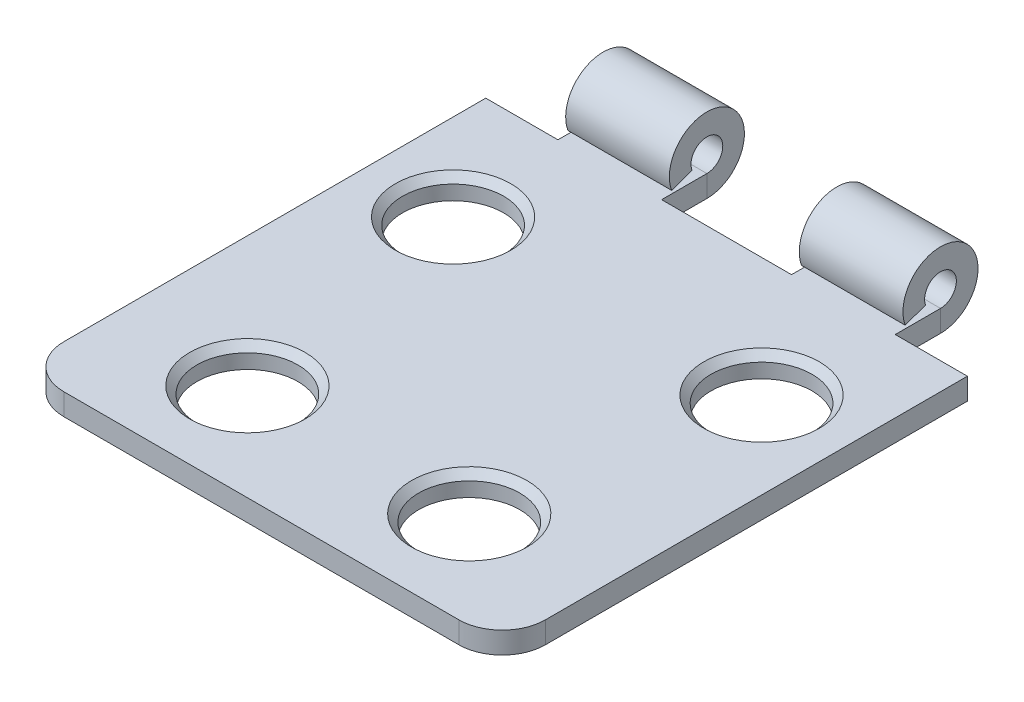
ISO-10303-21;
HEADER;
FILE_DESCRIPTION(('STEP AP214'),'2;1');
FILE_NAME('part.step','',(''),(''),'','','');
FILE_SCHEMA(('AUTOMOTIVE_DESIGN { 1 0 10303 214 1 1 1 1 }'));
ENDSEC;
DATA;
#1=APPLICATION_CONTEXT('core data for automotive mechanical design processes');
#2=APPLICATION_PROTOCOL_DEFINITION('international standard','automotive_design',2000,#1);
#3=PRODUCT_CONTEXT('',#1,'mechanical');
#4=PRODUCT('Part','Part','',(#3));
#5=PRODUCT_RELATED_PRODUCT_CATEGORY('part','',(#4));
#6=PRODUCT_DEFINITION_FORMATION('','',#4);
#7=PRODUCT_DEFINITION_CONTEXT('part definition',#1,'design');
#8=PRODUCT_DEFINITION('design','',#6,#7);
#9=PRODUCT_DEFINITION_SHAPE('','',#8);
#10=(LENGTH_UNIT() NAMED_UNIT(*) SI_UNIT(.MILLI.,.METRE.));
#11=(NAMED_UNIT(*) PLANE_ANGLE_UNIT() SI_UNIT($,.RADIAN.));
#12=(NAMED_UNIT(*) SI_UNIT($,.STERADIAN.) SOLID_ANGLE_UNIT());
#13=UNCERTAINTY_MEASURE_WITH_UNIT(LENGTH_MEASURE(1.E-05),#10,'distance_accuracy_value','');
#14=(GEOMETRIC_REPRESENTATION_CONTEXT(3) GLOBAL_UNCERTAINTY_ASSIGNED_CONTEXT((#13)) GLOBAL_UNIT_ASSIGNED_CONTEXT((#10,
#11,#12)) REPRESENTATION_CONTEXT('',''));
#15=CARTESIAN_POINT('',(0.,0.,0.));
#16=DIRECTION('',(0.,0.,1.));
#17=DIRECTION('',(1.,0.,0.));
#18=AXIS2_PLACEMENT_3D('',#15,#16,#17);
#19=CARTESIAN_POINT('',(7.47949999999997,-0.494291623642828,-7.42179302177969));
#20=DIRECTION('',(0.,1.,0.));
#21=DIRECTION('',(0.,0.,1.));
#22=AXIS2_PLACEMENT_3D('',#19,#20,#21);
#23=CONICAL_SURFACE('',#22,2.44999999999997,0.785398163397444);
#24=CARTESIAN_POINT('',(7.47949999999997,-0.144291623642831,-7.42179302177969));
#25=DIRECTION('',(0.,-1.,0.));
#26=DIRECTION('',(0.,0.,-1.));
#27=AXIS2_PLACEMENT_3D('',#24,#25,#26);
#28=CIRCLE('',#27,2.79999999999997);
#29=CARTESIAN_POINT('',(7.47949999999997,-0.144291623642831,-10.2217930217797));
#30=VERTEX_POINT('',#29);
#31=EDGE_CURVE('E342',#30,#30,#28,.T.);
#32=ORIENTED_EDGE('',*,*,#31,.F.);
#33=EDGE_LOOP('',(#32));
#34=FACE_BOUND('',#33,.T.);
#35=CARTESIAN_POINT('',(7.47949999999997,-0.494291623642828,-7.42179302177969));
#36=DIRECTION('',(0.,-1.,0.));
#37=DIRECTION('',(0.,0.,-1.));
#38=AXIS2_PLACEMENT_3D('',#35,#36,#37);
#39=CIRCLE('',#38,2.44999999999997);
#40=CARTESIAN_POINT('',(7.47949999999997,-0.494291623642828,-9.87179302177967));
#41=VERTEX_POINT('',#40);
#42=EDGE_CURVE('E215',#41,#41,#39,.F.);
#43=ORIENTED_EDGE('',*,*,#42,.F.);
#44=EDGE_LOOP('',(#43));
#45=FACE_BOUND('',#44,.T.);
#46=ADVANCED_FACE('F49',(#34,#45),#23,.F.);
#47=CARTESIAN_POINT('',(5.37949999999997,-0.494291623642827,4.6533491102));
#48=DIRECTION('',(0.,1.,0.));
#49=DIRECTION('',(0.,0.,1.));
#50=AXIS2_PLACEMENT_3D('',#47,#48,#49);
#51=CONICAL_SURFACE('',#50,2.45,0.78539816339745);
#52=CARTESIAN_POINT('',(5.37949999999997,-0.144291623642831,4.6533491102));
#53=DIRECTION('',(0.,-1.,0.));
#54=DIRECTION('',(0.,0.,-1.));
#55=AXIS2_PLACEMENT_3D('',#52,#53,#54);
#56=CIRCLE('',#55,2.8);
#57=CARTESIAN_POINT('',(5.37949999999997,-0.144291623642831,1.8533491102));
#58=VERTEX_POINT('',#57);
#59=EDGE_CURVE('E345',#58,#58,#56,.T.);
#60=ORIENTED_EDGE('',*,*,#59,.F.);
#61=EDGE_LOOP('',(#60));
#62=FACE_BOUND('',#61,.T.);
#63=CARTESIAN_POINT('',(5.37949999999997,-0.494291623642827,4.6533491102));
#64=DIRECTION('',(0.,-1.,0.));
#65=DIRECTION('',(0.,0.,-1.));
#66=AXIS2_PLACEMENT_3D('',#63,#64,#65);
#67=CIRCLE('',#66,2.45);
#68=CARTESIAN_POINT('',(5.37949999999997,-0.494291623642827,2.2033491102));
#69=VERTEX_POINT('',#68);
#70=EDGE_CURVE('E218',#69,#69,#67,.F.);
#71=ORIENTED_EDGE('',*,*,#70,.F.);
#72=EDGE_LOOP('',(#71));
#73=FACE_BOUND('',#72,.T.);
#74=ADVANCED_FACE('F420',(#62,#73),#51,.F.);
#75=CARTESIAN_POINT('',(-5.37950000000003,-0.494291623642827,4.6533491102));
#76=DIRECTION('',(0.,1.,0.));
#77=DIRECTION('',(0.,0.,1.));
#78=AXIS2_PLACEMENT_3D('',#75,#76,#77);
#79=CONICAL_SURFACE('',#78,2.45,0.78539816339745);
#80=CARTESIAN_POINT('',(-5.37950000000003,-0.144291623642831,4.6533491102));
#81=DIRECTION('',(0.,-1.,0.));
#82=DIRECTION('',(0.,0.,-1.));
#83=AXIS2_PLACEMENT_3D('',#80,#81,#82);
#84=CIRCLE('',#83,2.8);
#85=CARTESIAN_POINT('',(-5.37950000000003,-0.144291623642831,1.8533491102));
#86=VERTEX_POINT('',#85);
#87=EDGE_CURVE('E348',#86,#86,#84,.T.);
#88=ORIENTED_EDGE('',*,*,#87,.F.);
#89=EDGE_LOOP('',(#88));
#90=FACE_BOUND('',#89,.T.);
#91=CARTESIAN_POINT('',(-5.37950000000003,-0.494291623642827,4.6533491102));
#92=DIRECTION('',(0.,-1.,0.));
#93=DIRECTION('',(0.,0.,-1.));
#94=AXIS2_PLACEMENT_3D('',#91,#92,#93);
#95=CIRCLE('',#94,2.45);
#96=CARTESIAN_POINT('',(-5.37950000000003,-0.494291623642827,2.2033491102));
#97=VERTEX_POINT('',#96);
#98=EDGE_CURVE('E221',#97,#97,#95,.F.);
#99=ORIENTED_EDGE('',*,*,#98,.F.);
#100=EDGE_LOOP('',(#99));
#101=FACE_BOUND('',#100,.T.);
#102=ADVANCED_FACE('F426',(#90,#101),#79,.F.);
#103=CARTESIAN_POINT('',(-7.47950000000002,-0.494291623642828,-7.42179302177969));
#104=DIRECTION('',(0.,1.,0.));
#105=DIRECTION('',(0.,0.,1.));
#106=AXIS2_PLACEMENT_3D('',#103,#104,#105);
#107=CONICAL_SURFACE('',#106,2.44999999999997,0.785398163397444);
#108=CARTESIAN_POINT('',(-7.47950000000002,-0.144291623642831,-7.42179302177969));
#109=DIRECTION('',(0.,-1.,0.));
#110=DIRECTION('',(0.,0.,-1.));
#111=AXIS2_PLACEMENT_3D('',#108,#109,#110);
#112=CIRCLE('',#111,2.79999999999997);
#113=CARTESIAN_POINT('',(-7.47950000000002,-0.144291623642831,-10.2217930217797));
#114=VERTEX_POINT('',#113);
#115=EDGE_CURVE('E351',#114,#114,#112,.T.);
#116=ORIENTED_EDGE('',*,*,#115,.F.);
#117=EDGE_LOOP('',(#116));
#118=FACE_BOUND('',#117,.T.);
#119=CARTESIAN_POINT('',(-7.47950000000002,-0.494291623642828,-7.42179302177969));
#120=DIRECTION('',(0.,-1.,0.));
#121=DIRECTION('',(0.,0.,-1.));
#122=AXIS2_PLACEMENT_3D('',#119,#120,#121);
#123=CIRCLE('',#122,2.44999999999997);
#124=CARTESIAN_POINT('',(-7.47950000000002,-0.494291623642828,-9.87179302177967));
#125=VERTEX_POINT('',#124);
#126=EDGE_CURVE('E224',#125,#125,#123,.F.);
#127=ORIENTED_EDGE('',*,*,#126,.F.);
#128=EDGE_LOOP('',(#127));
#129=FACE_BOUND('',#128,.T.);
#130=ADVANCED_FACE('F437',(#118,#129),#107,.F.);
#131=CARTESIAN_POINT('',(-7.47950000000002,-1.19429162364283,-7.42179302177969));
#132=DIRECTION('',(0.,1.,0.));
#133=DIRECTION('',(0.,0.,1.));
#134=AXIS2_PLACEMENT_3D('',#131,#132,#133);
#135=CYLINDRICAL_SURFACE('',#134,2.44999999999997);
#136=ORIENTED_EDGE('',*,*,#126,.T.);
#137=EDGE_LOOP('',(#136));
#138=FACE_BOUND('',#137,.T.);
#139=CARTESIAN_POINT('',(-7.47950000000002,-1.19429162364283,-7.42179302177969));
#140=DIRECTION('',(0.,1.,0.));
#141=DIRECTION('',(0.,0.,1.));
#142=AXIS2_PLACEMENT_3D('',#139,#140,#141);
#143=CIRCLE('',#142,2.44999999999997);
#144=CARTESIAN_POINT('',(-7.47950000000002,-1.19429162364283,-4.97179302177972));
#145=VERTEX_POINT('',#144);
#146=EDGE_CURVE('E360',#145,#145,#143,.T.);
#147=ORIENTED_EDGE('',*,*,#146,.F.);
#148=EDGE_LOOP('',(#147));
#149=FACE_BOUND('',#148,.T.);
#150=ADVANCED_FACE('F441',(#138,#149),#135,.F.);
#151=CARTESIAN_POINT('',(-5.37950000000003,-1.19429162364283,4.6533491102));
#152=DIRECTION('',(0.,1.,0.));
#153=DIRECTION('',(0.,0.,1.));
#154=AXIS2_PLACEMENT_3D('',#151,#152,#153);
#155=CYLINDRICAL_SURFACE('',#154,2.45);
#156=ORIENTED_EDGE('',*,*,#98,.T.);
#157=EDGE_LOOP('',(#156));
#158=FACE_BOUND('',#157,.T.);
#159=CARTESIAN_POINT('',(-5.37950000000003,-1.19429162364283,4.6533491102));
#160=DIRECTION('',(0.,1.,0.));
#161=DIRECTION('',(0.,0.,1.));
#162=AXIS2_PLACEMENT_3D('',#159,#160,#161);
#163=CIRCLE('',#162,2.45);
#164=CARTESIAN_POINT('',(-5.37950000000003,-1.19429162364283,7.1033491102));
#165=VERTEX_POINT('',#164);
#166=EDGE_CURVE('E363',#165,#165,#163,.T.);
#167=ORIENTED_EDGE('',*,*,#166,.F.);
#168=EDGE_LOOP('',(#167));
#169=FACE_BOUND('',#168,.T.);
#170=ADVANCED_FACE('F445',(#158,#169),#155,.F.);
#171=CARTESIAN_POINT('',(5.37949999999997,-1.19429162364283,4.6533491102));
#172=DIRECTION('',(0.,1.,0.));
#173=DIRECTION('',(0.,0.,1.));
#174=AXIS2_PLACEMENT_3D('',#171,#172,#173);
#175=CYLINDRICAL_SURFACE('',#174,2.45);
#176=ORIENTED_EDGE('',*,*,#70,.T.);
#177=EDGE_LOOP('',(#176));
#178=FACE_BOUND('',#177,.T.);
#179=CARTESIAN_POINT('',(5.37949999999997,-1.19429162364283,4.6533491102));
#180=DIRECTION('',(0.,1.,0.));
#181=DIRECTION('',(0.,0.,-1.));
#182=AXIS2_PLACEMENT_3D('',#179,#180,#181);
#183=CIRCLE('',#182,2.45);
#184=CARTESIAN_POINT('',(5.37949999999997,-1.19429162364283,2.2033491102));
#185=VERTEX_POINT('',#184);
#186=EDGE_CURVE('E366',#185,#185,#183,.T.);
#187=ORIENTED_EDGE('',*,*,#186,.F.);
#188=EDGE_LOOP('',(#187));
#189=FACE_BOUND('',#188,.T.);
#190=ADVANCED_FACE('F449',(#178,#189),#175,.F.);
#191=CARTESIAN_POINT('',(7.47949999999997,-1.19429162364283,-7.42179302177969));
#192=DIRECTION('',(0.,1.,0.));
#193=DIRECTION('',(0.,0.,1.));
#194=AXIS2_PLACEMENT_3D('',#191,#192,#193);
#195=CYLINDRICAL_SURFACE('',#194,2.44999999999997);
#196=ORIENTED_EDGE('',*,*,#42,.T.);
#197=EDGE_LOOP('',(#196));
#198=FACE_BOUND('',#197,.T.);
#199=CARTESIAN_POINT('',(7.47949999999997,-1.19429162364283,-7.42179302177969));
#200=DIRECTION('',(0.,1.,0.));
#201=DIRECTION('',(0.,0.,-1.));
#202=AXIS2_PLACEMENT_3D('',#199,#200,#201);
#203=CIRCLE('',#202,2.44999999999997);
#204=CARTESIAN_POINT('',(7.47949999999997,-1.19429162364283,-9.87179302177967));
#205=VERTEX_POINT('',#204);
#206=EDGE_CURVE('E369',#205,#205,#203,.T.);
#207=ORIENTED_EDGE('',*,*,#206,.F.);
#208=EDGE_LOOP('',(#207));
#209=FACE_BOUND('',#208,.T.);
#210=ADVANCED_FACE('F453',(#198,#209),#195,.F.);
#211=CARTESIAN_POINT('',(-3.15000000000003,-3.64429162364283,-13.2063770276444));
#212=DIRECTION('',(0.,0.,1.));
#213=DIRECTION('',(1.,0.,0.));
#214=AXIS2_PLACEMENT_3D('',#211,#212,#213);
#215=PLANE('',#214);
#216=DIRECTION('',(-1.,0.,0.));
#217=VECTOR('',#216,1.);
#218=CARTESIAN_POINT('',(-10.2795000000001,-1.19429162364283,-13.2063770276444));
#219=LINE('',#218,#217);
#220=CARTESIAN_POINT('',(3.14999999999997,-1.19429162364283,-13.2063770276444));
#221=VERTEX_POINT('',#220);
#222=CARTESIAN_POINT('',(-3.15000000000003,-1.19429162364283,-13.2063770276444));
#223=VERTEX_POINT('',#222);
#224=EDGE_CURVE('E213',#221,#223,#219,.T.);
#225=ORIENTED_EDGE('',*,*,#224,.T.);
#226=DIRECTION('',(0.,1.,0.));
#227=VECTOR('',#226,1.);
#228=CARTESIAN_POINT('',(-3.15000000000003,-3.64429162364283,-13.2063770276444));
#229=LINE('',#228,#227);
#230=CARTESIAN_POINT('',(-3.15000000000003,-0.144291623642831,-13.2063770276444));
#231=VERTEX_POINT('',#230);
#232=EDGE_CURVE('E211',#223,#231,#229,.T.);
#233=ORIENTED_EDGE('',*,*,#232,.T.);
#234=DIRECTION('',(1.,0.,0.));
#235=VECTOR('',#234,1.);
#236=CARTESIAN_POINT('',(-3.15000000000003,-0.144291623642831,-13.2063770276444));
#237=LINE('',#236,#235);
#238=CARTESIAN_POINT('',(3.14999999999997,-0.144291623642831,-13.2063770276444));
#239=VERTEX_POINT('',#238);
#240=EDGE_CURVE('E205',#231,#239,#237,.T.);
#241=ORIENTED_EDGE('',*,*,#240,.T.);
#242=DIRECTION('',(0.,1.,0.));
#243=VECTOR('',#242,1.);
#244=CARTESIAN_POINT('',(3.14999999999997,-3.64429162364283,-13.2063770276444));
#245=LINE('',#244,#243);
#246=EDGE_CURVE('E338',#221,#239,#245,.T.);
#247=ORIENTED_EDGE('',*,*,#246,.F.);
#248=EDGE_LOOP('',(#225,#233,#241,#247));
#249=FACE_BOUND('',#248,.T.);
#250=ADVANCED_FACE('F457',(#249),#215,.F.);
#251=CARTESIAN_POINT('',(-8.17950000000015,-3.64429162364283,-13.2063770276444));
#252=DIRECTION('',(0.,0.,1.));
#253=DIRECTION('',(1.,0.,0.));
#254=AXIS2_PLACEMENT_3D('',#251,#252,#253);
#255=PLANE('',#254);
#256=DIRECTION('',(-1.,0.,0.));
#257=VECTOR('',#256,1.);
#258=CARTESIAN_POINT('',(-10.2795,-1.19429162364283,-13.2063770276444));
#259=LINE('',#258,#257);
#260=CARTESIAN_POINT('',(-8.17950000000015,-1.19429162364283,-13.2063770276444));
#261=VERTEX_POINT('',#260);
#262=CARTESIAN_POINT('',(-11.6795000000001,-1.19429162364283,-13.2063770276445));
#263=VERTEX_POINT('',#262);
#264=EDGE_CURVE('E193',#261,#263,#259,.T.);
#265=ORIENTED_EDGE('',*,*,#264,.T.);
#266=DIRECTION('',(0.,1.,0.));
#267=VECTOR('',#266,1.);
#268=CARTESIAN_POINT('',(-11.6795000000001,-7.14429162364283,-13.2063770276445));
#269=LINE('',#268,#267);
#270=CARTESIAN_POINT('',(-11.6795000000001,-0.144291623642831,-13.2063770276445));
#271=VERTEX_POINT('',#270);
#272=EDGE_CURVE('E179',#263,#271,#269,.T.);
#273=ORIENTED_EDGE('',*,*,#272,.T.);
#274=DIRECTION('',(1.,0.,0.));
#275=VECTOR('',#274,1.);
#276=CARTESIAN_POINT('',(-8.17950000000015,-0.144291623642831,-13.2063770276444));
#277=LINE('',#276,#275);
#278=CARTESIAN_POINT('',(-8.17950000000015,-0.144291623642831,-13.2063770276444));
#279=VERTEX_POINT('',#278);
#280=EDGE_CURVE('E190',#271,#279,#277,.T.);
#281=ORIENTED_EDGE('',*,*,#280,.T.);
#282=DIRECTION('',(0.,1.,0.));
#283=VECTOR('',#282,1.);
#284=CARTESIAN_POINT('',(-8.17950000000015,-3.64429162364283,-13.2063770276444));
#285=LINE('',#284,#283);
#286=EDGE_CURVE('E326',#261,#279,#285,.T.);
#287=ORIENTED_EDGE('',*,*,#286,.F.);
#288=EDGE_LOOP('',(#265,#273,#281,#287));
#289=FACE_BOUND('',#288,.T.);
#290=ADVANCED_FACE('F188',(#289),#255,.F.);
#291=CARTESIAN_POINT('',(14.4794999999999,-3.64429162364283,-13.2063770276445));
#292=DIRECTION('',(0.,0.,1.));
#293=DIRECTION('',(1.,0.,0.));
#294=AXIS2_PLACEMENT_3D('',#291,#292,#293);
#295=PLANE('',#294);
#296=DIRECTION('',(1.,0.,0.));
#297=VECTOR('',#296,1.);
#298=CARTESIAN_POINT('',(14.4794999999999,-0.144291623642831,-13.2063770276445));
#299=LINE('',#298,#297);
#300=CARTESIAN_POINT('',(8.17949999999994,-0.144291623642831,-13.2063770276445));
#301=VERTEX_POINT('',#300);
#302=CARTESIAN_POINT('',(11.6795000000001,-0.144291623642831,-13.2063770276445));
#303=VERTEX_POINT('',#302);
#304=EDGE_CURVE('E376',#301,#303,#299,.T.);
#305=ORIENTED_EDGE('',*,*,#304,.T.);
#306=DIRECTION('',(0.,1.,0.));
#307=VECTOR('',#306,1.);
#308=CARTESIAN_POINT('',(11.6795000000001,-7.14429162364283,-13.2063770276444));
#309=LINE('',#308,#307);
#310=CARTESIAN_POINT('',(11.6795000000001,-1.19429162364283,-13.2063770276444));
#311=VERTEX_POINT('',#310);
#312=EDGE_CURVE('E267',#311,#303,#309,.T.);
#313=ORIENTED_EDGE('',*,*,#312,.F.);
#314=DIRECTION('',(-1.,0.,0.));
#315=VECTOR('',#314,1.);
#316=CARTESIAN_POINT('',(-10.2795000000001,-1.19429162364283,-13.2063770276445));
#317=LINE('',#316,#315);
#318=CARTESIAN_POINT('',(8.17949999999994,-1.19429162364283,-13.2063770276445));
#319=VERTEX_POINT('',#318);
#320=EDGE_CURVE('E201',#311,#319,#317,.T.);
#321=ORIENTED_EDGE('',*,*,#320,.T.);
#322=DIRECTION('',(0.,1.,0.));
#323=VECTOR('',#322,1.);
#324=CARTESIAN_POINT('',(8.17949999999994,-3.64429162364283,-13.2063770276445));
#325=LINE('',#324,#323);
#326=EDGE_CURVE('E203',#319,#301,#325,.T.);
#327=ORIENTED_EDGE('',*,*,#326,.T.);
#328=EDGE_LOOP('',(#305,#313,#321,#327));
#329=FACE_BOUND('',#328,.T.);
#330=ADVANCED_FACE('F379',(#329),#295,.F.);
#331=CARTESIAN_POINT('',(-10.2795000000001,-1.19429162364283,10.4772069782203));
#332=DIRECTION('',(0.,-1.,0.));
#333=DIRECTION('',(0.,0.,-1.));
#334=AXIS2_PLACEMENT_3D('',#331,#332,#333);
#335=PLANE('',#334);
#336=DIRECTION('',(0.,0.,-1.));
#337=VECTOR('',#336,1.);
#338=CARTESIAN_POINT('',(11.6795,-1.19429162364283,10.4772069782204));
#339=LINE('',#338,#337);
#340=CARTESIAN_POINT('',(11.6795,-1.19429162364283,7.25720697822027));
#341=VERTEX_POINT('',#340);
#342=EDGE_CURVE('E194',#341,#311,#339,.T.);
#343=ORIENTED_EDGE('',*,*,#342,.F.);
#344=CARTESIAN_POINT('',(9.57949999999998,-1.19429162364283,7.25720697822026));
#345=DIRECTION('',(0.,-1.,0.));
#346=DIRECTION('',(0.,0.,-1.));
#347=AXIS2_PLACEMENT_3D('',#344,#345,#346);
#348=CIRCLE('',#347,2.1);
#349=CARTESIAN_POINT('',(9.57949999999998,-1.19429162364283,9.35720697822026));
#350=VERTEX_POINT('',#349);
#351=EDGE_CURVE('E57',#341,#350,#348,.T.);
#352=ORIENTED_EDGE('',*,*,#351,.T.);
#353=DIRECTION('',(1.,0.,0.));
#354=VECTOR('',#353,1.);
#355=CARTESIAN_POINT('',(-10.2795000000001,-1.19429162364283,9.35720697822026));
#356=LINE('',#355,#354);
#357=CARTESIAN_POINT('',(-9.57950000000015,-1.19429162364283,9.35720697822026));
#358=VERTEX_POINT('',#357);
#359=EDGE_CURVE('E259',#358,#350,#356,.T.);
#360=ORIENTED_EDGE('',*,*,#359,.F.);
#361=CARTESIAN_POINT('',(-9.57950000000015,-1.19429162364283,7.25720697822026));
#362=DIRECTION('',(0.,-1.,0.));
#363=DIRECTION('',(0.,0.,-1.));
#364=AXIS2_PLACEMENT_3D('',#361,#362,#363);
#365=CIRCLE('',#364,2.1);
#366=CARTESIAN_POINT('',(-11.6795000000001,-1.19429162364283,7.25720697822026));
#367=VERTEX_POINT('',#366);
#368=EDGE_CURVE('E64',#358,#367,#365,.T.);
#369=ORIENTED_EDGE('',*,*,#368,.T.);
#370=DIRECTION('',(0.,0.,1.));
#371=VECTOR('',#370,1.);
#372=CARTESIAN_POINT('',(-11.6795000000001,-1.19429162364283,10.4772069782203));
#373=LINE('',#372,#371);
#374=EDGE_CURVE('E280',#263,#367,#373,.T.);
#375=ORIENTED_EDGE('',*,*,#374,.F.);
#376=ORIENTED_EDGE('',*,*,#264,.F.);
#377=DIRECTION('',(0.,0.,1.));
#378=VECTOR('',#377,1.);
#379=CARTESIAN_POINT('',(-8.17950000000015,-1.19429162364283,10.4772069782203));
#380=LINE('',#379,#378);
#381=CARTESIAN_POINT('',(-8.17950000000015,-1.19429162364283,-15.4017930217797));
#382=VERTEX_POINT('',#381);
#383=EDGE_CURVE('E328',#382,#261,#380,.T.);
#384=ORIENTED_EDGE('',*,*,#383,.F.);
#385=DIRECTION('',(1.,0.,0.));
#386=VECTOR('',#385,1.);
#387=CARTESIAN_POINT('',(-14.4795000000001,-1.19429162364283,-15.4017930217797));
#388=LINE('',#387,#386);
#389=CARTESIAN_POINT('',(-3.15000000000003,-1.19429162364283,-15.4017930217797));
#390=VERTEX_POINT('',#389);
#391=EDGE_CURVE('E374',#382,#390,#388,.T.);
#392=ORIENTED_EDGE('',*,*,#391,.T.);
#393=DIRECTION('',(0.,0.,-1.));
#394=VECTOR('',#393,1.);
#395=CARTESIAN_POINT('',(-3.15000000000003,-1.19429162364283,10.4772069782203));
#396=LINE('',#395,#394);
#397=EDGE_CURVE('E330',#223,#390,#396,.T.);
#398=ORIENTED_EDGE('',*,*,#397,.F.);
#399=ORIENTED_EDGE('',*,*,#224,.F.);
#400=DIRECTION('',(0.,0.,1.));
#401=VECTOR('',#400,1.);
#402=CARTESIAN_POINT('',(3.14999999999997,-1.19429162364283,10.4772069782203));
#403=LINE('',#402,#401);
#404=CARTESIAN_POINT('',(3.14999999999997,-1.19429162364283,-15.4017930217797));
#405=VERTEX_POINT('',#404);
#406=EDGE_CURVE('E340',#405,#221,#403,.T.);
#407=ORIENTED_EDGE('',*,*,#406,.F.);
#408=DIRECTION('',(1.,0.,0.));
#409=VECTOR('',#408,1.);
#410=CARTESIAN_POINT('',(-14.4795000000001,-1.19429162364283,-15.4017930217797));
#411=LINE('',#410,#409);
#412=CARTESIAN_POINT('',(8.17949999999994,-1.19429162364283,-15.4017930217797));
#413=VERTEX_POINT('',#412);
#414=EDGE_CURVE('E372',#405,#413,#411,.T.);
#415=ORIENTED_EDGE('',*,*,#414,.T.);
#416=DIRECTION('',(0.,0.,-1.));
#417=VECTOR('',#416,1.);
#418=CARTESIAN_POINT('',(8.17949999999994,-1.19429162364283,10.4772069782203));
#419=LINE('',#418,#417);
#420=EDGE_CURVE('E354',#319,#413,#419,.T.);
#421=ORIENTED_EDGE('',*,*,#420,.F.);
#422=ORIENTED_EDGE('',*,*,#320,.F.);
#423=EDGE_LOOP('',(#343,#352,#360,#369,#375,#376,#384,#392,#398,#399,#407,#415,#421,#422));
#424=FACE_BOUND('',#423,.T.);
#425=ORIENTED_EDGE('',*,*,#206,.T.);
#426=EDGE_LOOP('',(#425));
#427=FACE_BOUND('',#426,.T.);
#428=ORIENTED_EDGE('',*,*,#186,.T.);
#429=EDGE_LOOP('',(#428));
#430=FACE_BOUND('',#429,.T.);
#431=ORIENTED_EDGE('',*,*,#166,.T.);
#432=EDGE_LOOP('',(#431));
#433=FACE_BOUND('',#432,.T.);
#434=ORIENTED_EDGE('',*,*,#146,.T.);
#435=EDGE_LOOP('',(#434));
#436=FACE_BOUND('',#435,.T.);
#437=ADVANCED_FACE('F257',(#424,#427,#430,#433,#436),#335,.T.);
#438=CARTESIAN_POINT('',(8.17949999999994,-3.64429162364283,-21.9563770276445));
#439=DIRECTION('',(-1.,0.,0.));
#440=DIRECTION('',(0.,0.,1.));
#441=AXIS2_PLACEMENT_3D('',#438,#439,#440);
#442=PLANE('',#441);
#443=DIRECTION('',(0.,-1.,0.));
#444=VECTOR('',#443,1.);
#445=CARTESIAN_POINT('',(8.17949999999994,-0.144291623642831,-15.4017930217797));
#446=LINE('',#445,#444);
#447=CARTESIAN_POINT('',(8.17949999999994,-0.144291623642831,-15.4017930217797));
#448=VERTEX_POINT('',#447);
#449=EDGE_CURVE('E227',#448,#413,#446,.T.);
#450=ORIENTED_EDGE('',*,*,#449,.F.);
#451=DIRECTION('',(0.,0.,1.));
#452=VECTOR('',#451,1.);
#453=CARTESIAN_POINT('',(8.17949999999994,-0.144291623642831,-21.9563770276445));
#454=LINE('',#453,#452);
#455=EDGE_CURVE('E357',#448,#301,#454,.T.);
#456=ORIENTED_EDGE('',*,*,#455,.T.);
#457=ORIENTED_EDGE('',*,*,#326,.F.);
#458=ORIENTED_EDGE('',*,*,#420,.T.);
#459=EDGE_LOOP('',(#450,#456,#457,#458));
#460=FACE_BOUND('',#459,.T.);
#461=ADVANCED_FACE('F383',(#460),#442,.F.);
#462=CARTESIAN_POINT('',(-10.2795000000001,-0.144291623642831,10.4772069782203));
#463=DIRECTION('',(0.,-1.,0.));
#464=DIRECTION('',(0.,0.,-1.));
#465=AXIS2_PLACEMENT_3D('',#462,#463,#464);
#466=PLANE('',#465);
#467=ORIENTED_EDGE('',*,*,#115,.T.);
#468=EDGE_LOOP('',(#467));
#469=FACE_BOUND('',#468,.T.);
#470=ORIENTED_EDGE('',*,*,#87,.T.);
#471=EDGE_LOOP('',(#470));
#472=FACE_BOUND('',#471,.T.);
#473=ORIENTED_EDGE('',*,*,#59,.T.);
#474=EDGE_LOOP('',(#473));
#475=FACE_BOUND('',#474,.T.);
#476=ORIENTED_EDGE('',*,*,#31,.T.);
#477=EDGE_LOOP('',(#476));
#478=FACE_BOUND('',#477,.T.);
#479=DIRECTION('',(-1.,0.,0.));
#480=VECTOR('',#479,1.);
#481=CARTESIAN_POINT('',(-12.0918756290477,-0.144291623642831,9.35720697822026));
#482=LINE('',#481,#480);
#483=CARTESIAN_POINT('',(9.57949999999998,-0.144291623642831,9.35720697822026));
#484=VERTEX_POINT('',#483);
#485=CARTESIAN_POINT('',(-9.57950000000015,-0.144291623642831,9.35720697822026));
#486=VERTEX_POINT('',#485);
#487=EDGE_CURVE('E268',#484,#486,#482,.T.);
#488=ORIENTED_EDGE('',*,*,#487,.F.);
#489=CARTESIAN_POINT('',(9.57949999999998,-0.144291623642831,7.25720697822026));
#490=DIRECTION('',(0.,-1.,0.));
#491=DIRECTION('',(0.,0.,-1.));
#492=AXIS2_PLACEMENT_3D('',#489,#490,#491);
#493=CIRCLE('',#492,2.1);
#494=CARTESIAN_POINT('',(11.6795,-0.144291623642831,7.25720697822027));
#495=VERTEX_POINT('',#494);
#496=EDGE_CURVE('E252',#484,#495,#493,.F.);
#497=ORIENTED_EDGE('',*,*,#496,.T.);
#498=DIRECTION('',(0.,0.,1.));
#499=VECTOR('',#498,1.);
#500=CARTESIAN_POINT('',(11.6795000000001,-0.144291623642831,-13.2063770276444));
#501=LINE('',#500,#499);
#502=EDGE_CURVE('E195',#303,#495,#501,.T.);
#503=ORIENTED_EDGE('',*,*,#502,.F.);
#504=ORIENTED_EDGE('',*,*,#304,.F.);
#505=ORIENTED_EDGE('',*,*,#455,.F.);
#506=DIRECTION('',(1.,0.,0.));
#507=VECTOR('',#506,1.);
#508=CARTESIAN_POINT('',(-14.4795000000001,-0.144291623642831,-15.4017930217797));
#509=LINE('',#508,#507);
#510=CARTESIAN_POINT('',(3.14999999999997,-0.144291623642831,-15.4017930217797));
#511=VERTEX_POINT('',#510);
#512=EDGE_CURVE('E230',#511,#448,#509,.T.);
#513=ORIENTED_EDGE('',*,*,#512,.F.);
#514=DIRECTION('',(0.,0.,-1.));
#515=VECTOR('',#514,1.);
#516=CARTESIAN_POINT('',(3.14999999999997,-0.144291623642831,-13.2063770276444));
#517=LINE('',#516,#515);
#518=EDGE_CURVE('E336',#239,#511,#517,.T.);
#519=ORIENTED_EDGE('',*,*,#518,.F.);
#520=ORIENTED_EDGE('',*,*,#240,.F.);
#521=DIRECTION('',(0.,0.,1.));
#522=VECTOR('',#521,1.);
#523=CARTESIAN_POINT('',(-3.15000000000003,-0.144291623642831,-13.2063770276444));
#524=LINE('',#523,#522);
#525=CARTESIAN_POINT('',(-3.15000000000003,-0.144291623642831,-15.4017930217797));
#526=VERTEX_POINT('',#525);
#527=EDGE_CURVE('E333',#526,#231,#524,.T.);
#528=ORIENTED_EDGE('',*,*,#527,.F.);
#529=DIRECTION('',(1.,0.,0.));
#530=VECTOR('',#529,1.);
#531=CARTESIAN_POINT('',(-14.4795000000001,-0.144291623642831,-15.4017930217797));
#532=LINE('',#531,#530);
#533=CARTESIAN_POINT('',(-8.17950000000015,-0.144291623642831,-15.4017930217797));
#534=VERTEX_POINT('',#533);
#535=EDGE_CURVE('E239',#534,#526,#532,.T.);
#536=ORIENTED_EDGE('',*,*,#535,.F.);
#537=DIRECTION('',(0.,0.,-1.));
#538=VECTOR('',#537,1.);
#539=CARTESIAN_POINT('',(-8.17950000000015,-0.144291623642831,-21.9563770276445));
#540=LINE('',#539,#538);
#541=EDGE_CURVE('E184',#279,#534,#540,.T.);
#542=ORIENTED_EDGE('',*,*,#541,.F.);
#543=ORIENTED_EDGE('',*,*,#280,.F.);
#544=DIRECTION('',(0.,0.,1.));
#545=VECTOR('',#544,1.);
#546=CARTESIAN_POINT('',(-11.6795000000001,-0.144291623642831,10.4772069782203));
#547=LINE('',#546,#545);
#548=CARTESIAN_POINT('',(-11.6795000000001,-0.144291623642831,7.25720697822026));
#549=VERTEX_POINT('',#548);
#550=EDGE_CURVE('E176',#271,#549,#547,.T.);
#551=ORIENTED_EDGE('',*,*,#550,.T.);
#552=CARTESIAN_POINT('',(-9.57950000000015,-0.144291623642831,7.25720697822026));
#553=DIRECTION('',(0.,-1.,0.));
#554=DIRECTION('',(0.,0.,-1.));
#555=AXIS2_PLACEMENT_3D('',#552,#553,#554);
#556=CIRCLE('',#555,2.1);
#557=EDGE_CURVE('E250',#549,#486,#556,.F.);
#558=ORIENTED_EDGE('',*,*,#557,.T.);
#559=EDGE_LOOP('',(#488,#497,#503,#504,#505,#513,#519,#520,#528,#536,#542,#543,#551,#558));
#560=FACE_BOUND('',#559,.T.);
#561=ADVANCED_FACE('F199',(#469,#472,#475,#478,#560),#466,.F.);
#562=CARTESIAN_POINT('',(3.14999999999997,-3.64429162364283,-13.2063770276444));
#563=DIRECTION('',(1.,0.,0.));
#564=DIRECTION('',(0.,0.,-1.));
#565=AXIS2_PLACEMENT_3D('',#562,#563,#564);
#566=PLANE('',#565);
#567=DIRECTION('',(0.,1.,0.));
#568=VECTOR('',#567,1.);
#569=CARTESIAN_POINT('',(3.14999999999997,-1.19429162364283,-15.4017930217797));
#570=LINE('',#569,#568);
#571=EDGE_CURVE('E233',#405,#511,#570,.T.);
#572=ORIENTED_EDGE('',*,*,#571,.F.);
#573=ORIENTED_EDGE('',*,*,#406,.T.);
#574=ORIENTED_EDGE('',*,*,#246,.T.);
#575=ORIENTED_EDGE('',*,*,#518,.T.);
#576=EDGE_LOOP('',(#572,#573,#574,#575));
#577=FACE_BOUND('',#576,.T.);
#578=ADVANCED_FACE('F472',(#577),#566,.F.);
#579=CARTESIAN_POINT('',(-3.15000000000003,-3.64429162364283,-13.2063770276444));
#580=DIRECTION('',(-1.,0.,0.));
#581=DIRECTION('',(0.,0.,1.));
#582=AXIS2_PLACEMENT_3D('',#579,#580,#581);
#583=PLANE('',#582);
#584=DIRECTION('',(0.,-1.,0.));
#585=VECTOR('',#584,1.);
#586=CARTESIAN_POINT('',(-3.15000000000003,-0.144291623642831,-15.4017930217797));
#587=LINE('',#586,#585);
#588=EDGE_CURVE('E236',#526,#390,#587,.T.);
#589=ORIENTED_EDGE('',*,*,#588,.F.);
#590=ORIENTED_EDGE('',*,*,#527,.T.);
#591=ORIENTED_EDGE('',*,*,#232,.F.);
#592=ORIENTED_EDGE('',*,*,#397,.T.);
#593=EDGE_LOOP('',(#589,#590,#591,#592));
#594=FACE_BOUND('',#593,.T.);
#595=ADVANCED_FACE('F476',(#594),#583,.F.);
#596=CARTESIAN_POINT('',(-8.17950000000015,-3.64429162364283,-21.9563770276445));
#597=DIRECTION('',(1.,0.,0.));
#598=DIRECTION('',(0.,0.,-1.));
#599=AXIS2_PLACEMENT_3D('',#596,#597,#598);
#600=PLANE('',#599);
#601=DIRECTION('',(0.,1.,0.));
#602=VECTOR('',#601,1.);
#603=CARTESIAN_POINT('',(-8.17950000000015,-1.19429162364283,-15.4017930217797));
#604=LINE('',#603,#602);
#605=EDGE_CURVE('E242',#382,#534,#604,.T.);
#606=ORIENTED_EDGE('',*,*,#605,.F.);
#607=ORIENTED_EDGE('',*,*,#383,.T.);
#608=ORIENTED_EDGE('',*,*,#286,.T.);
#609=ORIENTED_EDGE('',*,*,#541,.T.);
#610=EDGE_LOOP('',(#606,#607,#608,#609));
#611=FACE_BOUND('',#610,.T.);
#612=ADVANCED_FACE('F479',(#611),#600,.F.);
#613=CARTESIAN_POINT('',(-8.17950000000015,0.625708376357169,-15.4017930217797));
#614=DIRECTION('',(-1.,0.,0.));
#615=DIRECTION('',(0.,0.,1.));
#616=AXIS2_PLACEMENT_3D('',#613,#614,#615);
#617=PLANE('',#616);
#618=ORIENTED_EDGE('',*,*,#605,.T.);
#619=CARTESIAN_POINT('',(-8.17950000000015,0.625708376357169,-15.4017930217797));
#620=DIRECTION('',(1.,0.,0.));
#621=DIRECTION('',(0.,0.,-1.));
#622=AXIS2_PLACEMENT_3D('',#619,#620,#621);
#623=CIRCLE('',#622,0.77);
#624=CARTESIAN_POINT('',(-8.17950000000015,0.362352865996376,-14.6782297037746));
#625=VERTEX_POINT('',#624);
#626=EDGE_CURVE('E303',#534,#625,#623,.T.);
#627=ORIENTED_EDGE('',*,*,#626,.T.);
#628=DIRECTION('',(0.,-0.342020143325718,0.93969262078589));
#629=VECTOR('',#628,1.);
#630=CARTESIAN_POINT('',(-8.17950000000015,0.00323171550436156,-13.6915524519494));
#631=LINE('',#630,#629);
#632=CARTESIAN_POINT('',(-8.17950000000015,0.00323171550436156,-13.6915524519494));
#633=VERTEX_POINT('',#632);
#634=EDGE_CURVE('E244',#625,#633,#631,.T.);
#635=ORIENTED_EDGE('',*,*,#634,.T.);
#636=CARTESIAN_POINT('',(-8.17950000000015,0.625708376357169,-15.4017930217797));
#637=DIRECTION('',(1.,0.,0.));
#638=DIRECTION('',(0.,0.,-1.));
#639=AXIS2_PLACEMENT_3D('',#636,#637,#638);
#640=CIRCLE('',#639,1.82);
#641=EDGE_CURVE('E305',#382,#633,#640,.T.);
#642=ORIENTED_EDGE('',*,*,#641,.F.);
#643=EDGE_LOOP('',(#618,#627,#635,#642));
#644=FACE_BOUND('',#643,.T.);
#645=ADVANCED_FACE('F432',(#644),#617,.T.);
#646=CARTESIAN_POINT('',(-5.66475000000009,0.00323171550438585,-13.6915524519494));
#647=DIRECTION('',(0.,-0.939692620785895,-0.342020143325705));
#648=DIRECTION('',(1.,0.,0.));
#649=AXIS2_PLACEMENT_3D('',#646,#647,#648);
#650=PLANE('',#649);
#651=ORIENTED_EDGE('',*,*,#634,.F.);
#652=DIRECTION('',(1.,0.,0.));
#653=VECTOR('',#652,1.);
#654=CARTESIAN_POINT('',(-13.9930716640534,0.362352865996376,-14.6782297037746));
#655=LINE('',#654,#653);
#656=CARTESIAN_POINT('',(-3.15000000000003,0.362352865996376,-14.6782297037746));
#657=VERTEX_POINT('',#656);
#658=EDGE_CURVE('E318',#625,#657,#655,.T.);
#659=ORIENTED_EDGE('',*,*,#658,.T.);
#660=DIRECTION('',(0.,-0.342020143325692,0.9396926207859));
#661=VECTOR('',#660,1.);
#662=CARTESIAN_POINT('',(-3.15000000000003,0.00323171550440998,-13.6915524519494));
#663=LINE('',#662,#661);
#664=CARTESIAN_POINT('',(-3.15000000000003,0.00323171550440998,-13.6915524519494));
#665=VERTEX_POINT('',#664);
#666=EDGE_CURVE('E315',#657,#665,#663,.T.);
#667=ORIENTED_EDGE('',*,*,#666,.T.);
#668=DIRECTION('',(1.,0.,0.));
#669=VECTOR('',#668,1.);
#670=CARTESIAN_POINT('',(-8.17950000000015,0.00323171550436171,-13.6915524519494));
#671=LINE('',#670,#669);
#672=EDGE_CURVE('E308',#633,#665,#671,.T.);
#673=ORIENTED_EDGE('',*,*,#672,.F.);
#674=EDGE_LOOP('',(#651,#659,#667,#673));
#675=FACE_BOUND('',#674,.T.);
#676=ADVANCED_FACE('F670',(#675),#650,.T.);
#677=CARTESIAN_POINT('',(-3.15000000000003,0.625708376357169,-15.4017930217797));
#678=DIRECTION('',(1.,0.,0.));
#679=DIRECTION('',(0.,0.,-1.));
#680=AXIS2_PLACEMENT_3D('',#677,#678,#679);
#681=PLANE('',#680);
#682=ORIENTED_EDGE('',*,*,#666,.F.);
#683=CARTESIAN_POINT('',(-3.15000000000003,0.625708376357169,-15.4017930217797));
#684=DIRECTION('',(1.,0.,0.));
#685=DIRECTION('',(0.,0.,-1.));
#686=AXIS2_PLACEMENT_3D('',#683,#684,#685);
#687=CIRCLE('',#686,0.77);
#688=EDGE_CURVE('E309',#657,#526,#687,.F.);
#689=ORIENTED_EDGE('',*,*,#688,.T.);
#690=ORIENTED_EDGE('',*,*,#588,.T.);
#691=CARTESIAN_POINT('',(-3.15000000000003,0.625708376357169,-15.4017930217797));
#692=DIRECTION('',(-1.,0.,0.));
#693=DIRECTION('',(0.,0.,1.));
#694=AXIS2_PLACEMENT_3D('',#691,#692,#693);
#695=CIRCLE('',#694,1.82);
#696=EDGE_CURVE('E312',#665,#390,#695,.T.);
#697=ORIENTED_EDGE('',*,*,#696,.F.);
#698=EDGE_LOOP('',(#682,#689,#690,#697));
#699=FACE_BOUND('',#698,.T.);
#700=ADVANCED_FACE('F676',(#699),#681,.T.);
#701=CARTESIAN_POINT('',(-13.9930716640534,0.625708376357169,-15.4017930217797));
#702=DIRECTION('',(1.,0.,0.));
#703=DIRECTION('',(0.,0.,-1.));
#704=AXIS2_PLACEMENT_3D('',#701,#702,#703);
#705=CYLINDRICAL_SURFACE('',#704,1.82);
#706=ORIENTED_EDGE('',*,*,#696,.T.);
#707=ORIENTED_EDGE('',*,*,#391,.F.);
#708=ORIENTED_EDGE('',*,*,#641,.T.);
#709=ORIENTED_EDGE('',*,*,#672,.T.);
#710=EDGE_LOOP('',(#706,#707,#708,#709));
#711=FACE_BOUND('',#710,.T.);
#712=ADVANCED_FACE('F415',(#711),#705,.T.);
#713=CARTESIAN_POINT('',(-13.9930716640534,0.625708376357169,-15.4017930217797));
#714=DIRECTION('',(1.,0.,0.));
#715=DIRECTION('',(0.,0.,-1.));
#716=AXIS2_PLACEMENT_3D('',#713,#714,#715);
#717=CYLINDRICAL_SURFACE('',#716,0.77);
#718=ORIENTED_EDGE('',*,*,#688,.F.);
#719=ORIENTED_EDGE('',*,*,#658,.F.);
#720=ORIENTED_EDGE('',*,*,#626,.F.);
#721=ORIENTED_EDGE('',*,*,#535,.T.);
#722=EDGE_LOOP('',(#718,#719,#720,#721));
#723=FACE_BOUND('',#722,.T.);
#724=ADVANCED_FACE('F408',(#723),#717,.F.);
#725=CARTESIAN_POINT('',(8.17949999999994,0.625708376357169,-15.4017930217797));
#726=DIRECTION('',(1.,0.,0.));
#727=DIRECTION('',(0.,0.,-1.));
#728=AXIS2_PLACEMENT_3D('',#725,#726,#727);
#729=PLANE('',#728);
#730=DIRECTION('',(0.,-0.342020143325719,0.93969262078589));
#731=VECTOR('',#730,1.);
#732=CARTESIAN_POINT('',(8.17949999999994,0.00323171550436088,-13.6915524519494));
#733=LINE('',#732,#731);
#734=CARTESIAN_POINT('',(8.17949999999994,0.362352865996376,-14.6782297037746));
#735=VERTEX_POINT('',#734);
#736=CARTESIAN_POINT('',(8.17949999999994,0.00323171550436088,-13.6915524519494));
#737=VERTEX_POINT('',#736);
#738=EDGE_CURVE('E301',#735,#737,#733,.T.);
#739=ORIENTED_EDGE('',*,*,#738,.F.);
#740=CARTESIAN_POINT('',(8.17949999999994,0.625708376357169,-15.4017930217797));
#741=DIRECTION('',(1.,0.,0.));
#742=DIRECTION('',(0.,0.,-1.));
#743=AXIS2_PLACEMENT_3D('',#740,#741,#742);
#744=CIRCLE('',#743,0.77);
#745=EDGE_CURVE('E282',#735,#448,#744,.F.);
#746=ORIENTED_EDGE('',*,*,#745,.T.);
#747=ORIENTED_EDGE('',*,*,#449,.T.);
#748=CARTESIAN_POINT('',(8.17949999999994,0.625708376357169,-15.4017930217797));
#749=DIRECTION('',(-1.,0.,0.));
#750=DIRECTION('',(0.,0.,1.));
#751=AXIS2_PLACEMENT_3D('',#748,#749,#750);
#752=CIRCLE('',#751,1.82);
#753=EDGE_CURVE('E283',#737,#413,#752,.T.);
#754=ORIENTED_EDGE('',*,*,#753,.F.);
#755=EDGE_LOOP('',(#739,#746,#747,#754));
#756=FACE_BOUND('',#755,.T.);
#757=ADVANCED_FACE('F406',(#756),#729,.T.);
#758=CARTESIAN_POINT('',(3.14999999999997,0.625708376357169,-15.4017930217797));
#759=DIRECTION('',(-1.,0.,0.));
#760=DIRECTION('',(0.,0.,1.));
#761=AXIS2_PLACEMENT_3D('',#758,#759,#760);
#762=PLANE('',#761);
#763=ORIENTED_EDGE('',*,*,#571,.T.);
#764=CARTESIAN_POINT('',(3.14999999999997,0.625708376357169,-15.4017930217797));
#765=DIRECTION('',(1.,0.,0.));
#766=DIRECTION('',(0.,0.,-1.));
#767=AXIS2_PLACEMENT_3D('',#764,#765,#766);
#768=CIRCLE('',#767,0.77);
#769=CARTESIAN_POINT('',(3.14999999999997,0.362352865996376,-14.6782297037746));
#770=VERTEX_POINT('',#769);
#771=EDGE_CURVE('E294',#511,#770,#768,.T.);
#772=ORIENTED_EDGE('',*,*,#771,.T.);
#773=DIRECTION('',(0.,-0.342020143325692,0.9396926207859));
#774=VECTOR('',#773,1.);
#775=CARTESIAN_POINT('',(3.14999999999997,0.00323171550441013,-13.6915524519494));
#776=LINE('',#775,#774);
#777=CARTESIAN_POINT('',(3.14999999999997,0.00323171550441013,-13.6915524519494));
#778=VERTEX_POINT('',#777);
#779=EDGE_CURVE('E293',#770,#778,#776,.T.);
#780=ORIENTED_EDGE('',*,*,#779,.T.);
#781=CARTESIAN_POINT('',(3.14999999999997,0.625708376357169,-15.4017930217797));
#782=DIRECTION('',(1.,0.,0.));
#783=DIRECTION('',(0.,0.,-1.));
#784=AXIS2_PLACEMENT_3D('',#781,#782,#783);
#785=CIRCLE('',#784,1.82);
#786=EDGE_CURVE('E286',#405,#778,#785,.T.);
#787=ORIENTED_EDGE('',*,*,#786,.F.);
#788=EDGE_LOOP('',(#763,#772,#780,#787));
#789=FACE_BOUND('',#788,.T.);
#790=ADVANCED_FACE('F393',(#789),#762,.T.);
#791=CARTESIAN_POINT('',(5.66474999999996,0.00323171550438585,-13.6915524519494));
#792=DIRECTION('',(0.,-0.939692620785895,-0.342020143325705));
#793=DIRECTION('',(1.,0.,0.));
#794=AXIS2_PLACEMENT_3D('',#791,#792,#793);
#795=PLANE('',#794);
#796=DIRECTION('',(1.,0.,0.));
#797=VECTOR('',#796,1.);
#798=CARTESIAN_POINT('',(-2.66357166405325,0.362352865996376,-14.6782297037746));
#799=LINE('',#798,#797);
#800=EDGE_CURVE('E287',#770,#735,#799,.T.);
#801=ORIENTED_EDGE('',*,*,#800,.T.);
#802=ORIENTED_EDGE('',*,*,#738,.T.);
#803=DIRECTION('',(1.,0.,0.));
#804=VECTOR('',#803,1.);
#805=CARTESIAN_POINT('',(3.14999999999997,0.00323171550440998,-13.6915524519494));
#806=LINE('',#805,#804);
#807=EDGE_CURVE('E290',#778,#737,#806,.T.);
#808=ORIENTED_EDGE('',*,*,#807,.F.);
#809=ORIENTED_EDGE('',*,*,#779,.F.);
#810=EDGE_LOOP('',(#801,#802,#808,#809));
#811=FACE_BOUND('',#810,.T.);
#812=ADVANCED_FACE('F399',(#811),#795,.T.);
#813=CARTESIAN_POINT('',(-2.66357166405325,0.625708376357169,-15.4017930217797));
#814=DIRECTION('',(1.,0.,0.));
#815=DIRECTION('',(0.,0.,-1.));
#816=AXIS2_PLACEMENT_3D('',#813,#814,#815);
#817=CYLINDRICAL_SURFACE('',#816,1.82);
#818=ORIENTED_EDGE('',*,*,#786,.T.);
#819=ORIENTED_EDGE('',*,*,#807,.T.);
#820=ORIENTED_EDGE('',*,*,#753,.T.);
#821=ORIENTED_EDGE('',*,*,#414,.F.);
#822=EDGE_LOOP('',(#818,#819,#820,#821));
#823=FACE_BOUND('',#822,.T.);
#824=ADVANCED_FACE('F403',(#823),#817,.T.);
#825=CARTESIAN_POINT('',(-2.66357166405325,0.625708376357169,-15.4017930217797));
#826=DIRECTION('',(1.,0.,0.));
#827=DIRECTION('',(0.,0.,-1.));
#828=AXIS2_PLACEMENT_3D('',#825,#826,#827);
#829=CYLINDRICAL_SURFACE('',#828,0.77);
#830=ORIENTED_EDGE('',*,*,#771,.F.);
#831=ORIENTED_EDGE('',*,*,#512,.T.);
#832=ORIENTED_EDGE('',*,*,#745,.F.);
#833=ORIENTED_EDGE('',*,*,#800,.F.);
#834=EDGE_LOOP('',(#830,#831,#832,#833));
#835=FACE_BOUND('',#834,.T.);
#836=ADVANCED_FACE('F397',(#835),#829,.F.);
#837=CARTESIAN_POINT('',(11.6795000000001,-7.14429162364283,-13.2063770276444));
#838=DIRECTION('',(-1.,0.,0.));
#839=DIRECTION('',(0.,0.,1.));
#840=AXIS2_PLACEMENT_3D('',#837,#838,#839);
#841=PLANE('',#840);
#842=ORIENTED_EDGE('',*,*,#502,.T.);
#843=DIRECTION('',(0.,1.,0.));
#844=VECTOR('',#843,1.);
#845=CARTESIAN_POINT('',(11.6795,-7.14429162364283,7.25720697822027));
#846=LINE('',#845,#844);
#847=EDGE_CURVE('E72',#495,#341,#846,.F.);
#848=ORIENTED_EDGE('',*,*,#847,.T.);
#849=ORIENTED_EDGE('',*,*,#342,.T.);
#850=ORIENTED_EDGE('',*,*,#312,.T.);
#851=EDGE_LOOP('',(#842,#848,#849,#850));
#852=FACE_BOUND('',#851,.T.);
#853=ADVANCED_FACE('F274',(#852),#841,.F.);
#854=CARTESIAN_POINT('',(-11.6795000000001,-7.14429162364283,-13.2063770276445));
#855=DIRECTION('',(1.,0.,0.));
#856=DIRECTION('',(0.,0.,-1.));
#857=AXIS2_PLACEMENT_3D('',#854,#855,#856);
#858=PLANE('',#857);
#859=ORIENTED_EDGE('',*,*,#374,.T.);
#860=DIRECTION('',(0.,1.,0.));
#861=VECTOR('',#860,1.);
#862=CARTESIAN_POINT('',(-11.6795000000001,-7.14429162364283,7.25720697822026));
#863=LINE('',#862,#861);
#864=EDGE_CURVE('E12',#367,#549,#863,.T.);
#865=ORIENTED_EDGE('',*,*,#864,.T.);
#866=ORIENTED_EDGE('',*,*,#550,.F.);
#867=ORIENTED_EDGE('',*,*,#272,.F.);
#868=EDGE_LOOP('',(#859,#865,#866,#867));
#869=FACE_BOUND('',#868,.T.);
#870=ADVANCED_FACE('F178',(#869),#858,.F.);
#871=CARTESIAN_POINT('',(-12.0918756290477,-7.14429162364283,9.35720697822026));
#872=DIRECTION('',(0.,0.,-1.));
#873=DIRECTION('',(-1.,0.,0.));
#874=AXIS2_PLACEMENT_3D('',#871,#872,#873);
#875=PLANE('',#874);
#876=ORIENTED_EDGE('',*,*,#359,.T.);
#877=DIRECTION('',(0.,1.,0.));
#878=VECTOR('',#877,1.);
#879=CARTESIAN_POINT('',(9.57949999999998,-7.14429162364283,9.35720697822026));
#880=LINE('',#879,#878);
#881=EDGE_CURVE('E247',#350,#484,#880,.T.);
#882=ORIENTED_EDGE('',*,*,#881,.T.);
#883=ORIENTED_EDGE('',*,*,#487,.T.);
#884=DIRECTION('',(0.,1.,0.));
#885=VECTOR('',#884,1.);
#886=CARTESIAN_POINT('',(-9.57950000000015,-7.14429162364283,9.35720697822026));
#887=LINE('',#886,#885);
#888=EDGE_CURVE('E183',#486,#358,#887,.F.);
#889=ORIENTED_EDGE('',*,*,#888,.T.);
#890=EDGE_LOOP('',(#876,#882,#883,#889));
#891=FACE_BOUND('',#890,.T.);
#892=ADVANCED_FACE('F264',(#891),#875,.F.);
#893=CARTESIAN_POINT('',(9.57949999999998,-7.14429162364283,7.25720697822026));
#894=DIRECTION('',(0.,1.,0.));
#895=DIRECTION('',(0.,0.,1.));
#896=AXIS2_PLACEMENT_3D('',#893,#894,#895);
#897=CYLINDRICAL_SURFACE('',#896,2.1);
#898=ORIENTED_EDGE('',*,*,#351,.F.);
#899=ORIENTED_EDGE('',*,*,#847,.F.);
#900=ORIENTED_EDGE('',*,*,#496,.F.);
#901=ORIENTED_EDGE('',*,*,#881,.F.);
#902=EDGE_LOOP('',(#898,#899,#900,#901));
#903=FACE_BOUND('',#902,.T.);
#904=ADVANCED_FACE('F270',(#903),#897,.T.);
#905=CARTESIAN_POINT('',(-9.57950000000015,-7.14429162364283,7.25720697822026));
#906=DIRECTION('',(0.,1.,0.));
#907=DIRECTION('',(0.,0.,1.));
#908=AXIS2_PLACEMENT_3D('',#905,#906,#907);
#909=CYLINDRICAL_SURFACE('',#908,2.1);
#910=ORIENTED_EDGE('',*,*,#368,.F.);
#911=ORIENTED_EDGE('',*,*,#888,.F.);
#912=ORIENTED_EDGE('',*,*,#557,.F.);
#913=ORIENTED_EDGE('',*,*,#864,.F.);
#914=EDGE_LOOP('',(#910,#911,#912,#913));
#915=FACE_BOUND('',#914,.T.);
#916=ADVANCED_FACE('F51',(#915),#909,.T.);
#917=CLOSED_SHELL('',(#46,#74,#102,#130,#150,#170,#190,#210,#250,#290,#330,#437,#461,#561,#578,
#595,#612,#645,#676,#700,#712,#724,#757,#790,#812,#824,#836,#853,#870,#892,#904,#916));
#918=MANIFOLD_SOLID_BREP('B2',#917);
#919=ADVANCED_BREP_SHAPE_REPRESENTATION('',(#18,#918),#14);
#920=SHAPE_DEFINITION_REPRESENTATION(#9,#919);
ENDSEC;
END-ISO-10303-21;
